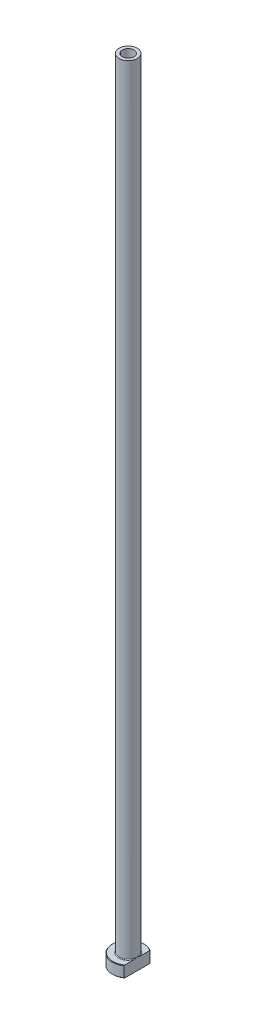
ISO-10303-21;
HEADER;
FILE_DESCRIPTION(('STEP AP214'),'2;1');
FILE_NAME('part.step','',(''),(''),'','','');
FILE_SCHEMA(('AUTOMOTIVE_DESIGN { 1 0 10303 214 1 1 1 1 }'));
ENDSEC;
DATA;
#1=APPLICATION_CONTEXT('core data for automotive mechanical design processes');
#2=APPLICATION_PROTOCOL_DEFINITION('international standard','automotive_design',2000,#1);
#3=PRODUCT_CONTEXT('',#1,'mechanical');
#4=PRODUCT('Part','Part','',(#3));
#5=PRODUCT_RELATED_PRODUCT_CATEGORY('part','',(#4));
#6=PRODUCT_DEFINITION_FORMATION('','',#4);
#7=PRODUCT_DEFINITION_CONTEXT('part definition',#1,'design');
#8=PRODUCT_DEFINITION('design','',#6,#7);
#9=PRODUCT_DEFINITION_SHAPE('','',#8);
#10=(LENGTH_UNIT() NAMED_UNIT(*) SI_UNIT(.MILLI.,.METRE.));
#11=(NAMED_UNIT(*) PLANE_ANGLE_UNIT() SI_UNIT($,.RADIAN.));
#12=(NAMED_UNIT(*) SI_UNIT($,.STERADIAN.) SOLID_ANGLE_UNIT());
#13=UNCERTAINTY_MEASURE_WITH_UNIT(LENGTH_MEASURE(1.E-05),#10,'distance_accuracy_value','');
#14=(GEOMETRIC_REPRESENTATION_CONTEXT(3) GLOBAL_UNCERTAINTY_ASSIGNED_CONTEXT((#13)) GLOBAL_UNIT_ASSIGNED_CONTEXT((#10,
#11,#12)) REPRESENTATION_CONTEXT('',''));
#15=CARTESIAN_POINT('',(0.,0.,0.));
#16=DIRECTION('',(0.,0.,1.));
#17=DIRECTION('',(1.,0.,0.));
#18=AXIS2_PLACEMENT_3D('',#15,#16,#17);
#19=CARTESIAN_POINT('',(0.,92.1876809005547,0.));
#20=DIRECTION('',(0.,1.,0.));
#21=DIRECTION('',(0.,0.,1.));
#22=AXIS2_PLACEMENT_3D('',#19,#20,#21);
#23=CYLINDRICAL_SURFACE('',#22,2.60000000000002);
#24=CARTESIAN_POINT('',(0.,350.,0.));
#25=DIRECTION('',(0.,1.,0.));
#26=DIRECTION('',(0.,0.,1.));
#27=AXIS2_PLACEMENT_3D('',#24,#25,#26);
#28=CIRCLE('',#27,2.60000000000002);
#29=CARTESIAN_POINT('',(0.,350.,2.60000000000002));
#30=VERTEX_POINT('',#29);
#31=EDGE_CURVE('E167',#30,#30,#28,.T.);
#32=ORIENTED_EDGE('',*,*,#31,.T.);
#33=EDGE_LOOP('',(#32));
#34=FACE_BOUND('',#33,.T.);
#35=CARTESIAN_POINT('',(0.,305.,0.));
#36=DIRECTION('',(0.,1.,0.));
#37=DIRECTION('',(0.,0.,1.));
#38=AXIS2_PLACEMENT_3D('',#35,#36,#37);
#39=CIRCLE('',#38,2.60000000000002);
#40=CARTESIAN_POINT('',(0.,305.,2.60000000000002));
#41=VERTEX_POINT('',#40);
#42=EDGE_CURVE('E170',#41,#41,#39,.T.);
#43=ORIENTED_EDGE('',*,*,#42,.F.);
#44=EDGE_LOOP('',(#43));
#45=FACE_BOUND('',#44,.T.);
#46=ADVANCED_FACE('F32',(#34,#45),#23,.F.);
#47=CARTESIAN_POINT('',(-2.60000000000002,350.,0.));
#48=DIRECTION('',(0.,1.,0.));
#49=DIRECTION('',(0.,0.,1.));
#50=AXIS2_PLACEMENT_3D('',#47,#48,#49);
#51=PLANE('',#50);
#52=CARTESIAN_POINT('',(0.,350.,0.));
#53=DIRECTION('',(0.,1.,0.));
#54=DIRECTION('',(0.,0.,1.));
#55=AXIS2_PLACEMENT_3D('',#52,#53,#54);
#56=CIRCLE('',#55,4.00000000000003);
#57=CARTESIAN_POINT('',(0.,350.,4.00000000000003));
#58=VERTEX_POINT('',#57);
#59=EDGE_CURVE('E174',#58,#58,#56,.T.);
#60=ORIENTED_EDGE('',*,*,#59,.T.);
#61=EDGE_LOOP('',(#60));
#62=FACE_BOUND('',#61,.T.);
#63=ORIENTED_EDGE('',*,*,#31,.F.);
#64=EDGE_LOOP('',(#63));
#65=FACE_BOUND('',#64,.T.);
#66=ADVANCED_FACE('F157',(#62,#65),#51,.T.);
#67=CARTESIAN_POINT('',(0.,92.1876809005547,0.));
#68=DIRECTION('',(0.,1.,0.));
#69=DIRECTION('',(0.,0.,1.));
#70=AXIS2_PLACEMENT_3D('',#67,#68,#69);
#71=CYLINDRICAL_SURFACE('',#70,4.00000000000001);
#72=CARTESIAN_POINT('',(0.,5.3,0.));
#73=DIRECTION('',(0.,1.,0.));
#74=DIRECTION('',(0.,0.,1.));
#75=AXIS2_PLACEMENT_3D('',#72,#73,#74);
#76=CIRCLE('',#75,4.00000000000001);
#77=CARTESIAN_POINT('',(4.,5.3,0.));
#78=VERTEX_POINT('',#77);
#79=EDGE_CURVE('E180',#78,#78,#76,.T.);
#80=ORIENTED_EDGE('',*,*,#79,.T.);
#81=EDGE_LOOP('',(#80));
#82=FACE_BOUND('',#81,.T.);
#83=ORIENTED_EDGE('',*,*,#59,.F.);
#84=EDGE_LOOP('',(#83));
#85=FACE_BOUND('',#84,.T.);
#86=ADVANCED_FACE('F162',(#82,#85),#71,.T.);
#87=CARTESIAN_POINT('',(-3.99999999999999,5.,0.));
#88=DIRECTION('',(0.,1.,0.));
#89=DIRECTION('',(0.,0.,1.));
#90=AXIS2_PLACEMENT_3D('',#87,#88,#89);
#91=PLANE('',#90);
#92=DIRECTION('',(0.,0.,1.));
#93=VECTOR('',#92,1.);
#94=CARTESIAN_POINT('',(4.,5.,0.));
#95=LINE('',#94,#93);
#96=CARTESIAN_POINT('',(4.,5.,-5.49909083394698));
#97=VERTEX_POINT('',#96);
#98=CARTESIAN_POINT('',(4.,5.,-1.57797338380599));
#99=VERTEX_POINT('',#98);
#100=EDGE_CURVE('E54',#97,#99,#95,.T.);
#101=ORIENTED_EDGE('',*,*,#100,.F.);
#102=CARTESIAN_POINT('',(0.,5.,0.));
#103=DIRECTION('',(0.,1.,0.));
#104=DIRECTION('',(0.,0.,1.));
#105=AXIS2_PLACEMENT_3D('',#102,#103,#104);
#106=CIRCLE('',#105,6.79999999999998);
#107=CARTESIAN_POINT('',(3.99999999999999,5.,5.49909083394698));
#108=VERTEX_POINT('',#107);
#109=EDGE_CURVE('E186',#97,#108,#106,.T.);
#110=ORIENTED_EDGE('',*,*,#109,.T.);
#111=CARTESIAN_POINT('',(4.,5.,1.57797338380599));
#112=VERTEX_POINT('',#111);
#113=EDGE_CURVE('E134',#112,#108,#95,.T.);
#114=ORIENTED_EDGE('',*,*,#113,.F.);
#115=CARTESIAN_POINT('',(0.,5.,0.));
#116=DIRECTION('',(0.,1.,0.));
#117=DIRECTION('',(0.,0.,1.));
#118=AXIS2_PLACEMENT_3D('',#115,#116,#117);
#119=CIRCLE('',#118,4.30000000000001);
#120=EDGE_CURVE('E183',#112,#99,#119,.F.);
#121=ORIENTED_EDGE('',*,*,#120,.T.);
#122=EDGE_LOOP('',(#101,#110,#114,#121));
#123=FACE_BOUND('',#122,.T.);
#124=ADVANCED_FACE('F197',(#123),#91,.T.);
#125=CARTESIAN_POINT('',(0.,92.1876809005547,0.));
#126=DIRECTION('',(0.,1.,0.));
#127=DIRECTION('',(0.,0.,1.));
#128=AXIS2_PLACEMENT_3D('',#125,#126,#127);
#129=CYLINDRICAL_SURFACE('',#128,6.99999999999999);
#130=DIRECTION('',(0.,-1.,0.));
#131=VECTOR('',#130,1.);
#132=CARTESIAN_POINT('',(3.99999999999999,350.,5.74456264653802));
#133=LINE('',#132,#131);
#134=CARTESIAN_POINT('',(3.99999999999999,4.8,5.74456264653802));
#135=VERTEX_POINT('',#134);
#136=CARTESIAN_POINT('',(3.99999999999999,0.199999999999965,5.74456264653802));
#137=VERTEX_POINT('',#136);
#138=EDGE_CURVE('E82',#135,#137,#133,.T.);
#139=ORIENTED_EDGE('',*,*,#138,.F.);
#140=CARTESIAN_POINT('',(0.,4.8,0.));
#141=DIRECTION('',(0.,1.,0.));
#142=DIRECTION('',(0.,0.,1.));
#143=AXIS2_PLACEMENT_3D('',#140,#141,#142);
#144=CIRCLE('',#143,6.99999999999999);
#145=CARTESIAN_POINT('',(4.,4.8,-5.74456264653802));
#146=VERTEX_POINT('',#145);
#147=EDGE_CURVE('E95',#135,#146,#144,.F.);
#148=ORIENTED_EDGE('',*,*,#147,.T.);
#149=DIRECTION('',(0.,-1.,0.));
#150=VECTOR('',#149,1.);
#151=CARTESIAN_POINT('',(4.,350.,-5.74456264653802));
#152=LINE('',#151,#150);
#153=CARTESIAN_POINT('',(4.,0.199999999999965,-5.74456264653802));
#154=VERTEX_POINT('',#153);
#155=EDGE_CURVE('E192',#146,#154,#152,.T.);
#156=ORIENTED_EDGE('',*,*,#155,.T.);
#157=CARTESIAN_POINT('',(0.,0.199999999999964,0.));
#158=DIRECTION('',(0.,-1.,0.));
#159=DIRECTION('',(0.,0.,-1.));
#160=AXIS2_PLACEMENT_3D('',#157,#158,#159);
#161=CIRCLE('',#160,6.99999999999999);
#162=EDGE_CURVE('E98',#154,#137,#161,.F.);
#163=ORIENTED_EDGE('',*,*,#162,.T.);
#164=EDGE_LOOP('',(#139,#148,#156,#163));
#165=FACE_BOUND('',#164,.T.);
#166=ADVANCED_FACE('F190',(#165),#129,.T.);
#167=CARTESIAN_POINT('',(-6.99999999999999,0.,0.));
#168=DIRECTION('',(0.,-1.,0.));
#169=DIRECTION('',(0.,0.,-1.));
#170=AXIS2_PLACEMENT_3D('',#167,#168,#169);
#171=PLANE('',#170);
#172=CARTESIAN_POINT('',(0.,0.,0.));
#173=DIRECTION('',(0.,-1.,0.));
#174=DIRECTION('',(0.,0.,-1.));
#175=AXIS2_PLACEMENT_3D('',#172,#173,#174);
#176=CIRCLE('',#175,3.34999999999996);
#177=CARTESIAN_POINT('',(0.,0.,-3.34999999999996));
#178=VERTEX_POINT('',#177);
#179=EDGE_CURVE('E40',#178,#178,#176,.F.);
#180=ORIENTED_EDGE('',*,*,#179,.T.);
#181=EDGE_LOOP('',(#180));
#182=FACE_BOUND('',#181,.T.);
#183=DIRECTION('',(0.,0.,-1.));
#184=VECTOR('',#183,1.);
#185=CARTESIAN_POINT('',(3.99999999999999,0.,5.74456264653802));
#186=LINE('',#185,#184);
#187=CARTESIAN_POINT('',(3.99999999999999,0.,5.49909083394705));
#188=VERTEX_POINT('',#187);
#189=CARTESIAN_POINT('',(4.,0.,-5.49909083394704));
#190=VERTEX_POINT('',#189);
#191=EDGE_CURVE('E47',#188,#190,#186,.T.);
#192=ORIENTED_EDGE('',*,*,#191,.F.);
#193=CARTESIAN_POINT('',(0.,0.,0.));
#194=DIRECTION('',(0.,-1.,0.));
#195=DIRECTION('',(0.,0.,-1.));
#196=AXIS2_PLACEMENT_3D('',#193,#194,#195);
#197=CIRCLE('',#196,6.80000000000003);
#198=EDGE_CURVE('E92',#188,#190,#197,.T.);
#199=ORIENTED_EDGE('',*,*,#198,.T.);
#200=EDGE_LOOP('',(#192,#199));
#201=FACE_BOUND('',#200,.T.);
#202=ADVANCED_FACE('F91',(#182,#201),#171,.T.);
#203=CARTESIAN_POINT('',(0.,92.1876809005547,0.));
#204=DIRECTION('',(0.,1.,0.));
#205=DIRECTION('',(0.,0.,1.));
#206=AXIS2_PLACEMENT_3D('',#203,#204,#205);
#207=CYLINDRICAL_SURFACE('',#206,2.85000000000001);
#208=CARTESIAN_POINT('',(0.,0.499999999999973,0.));
#209=DIRECTION('',(0.,-1.,0.));
#210=DIRECTION('',(0.,0.,-1.));
#211=AXIS2_PLACEMENT_3D('',#208,#209,#210);
#212=CIRCLE('',#211,2.85000000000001);
#213=CARTESIAN_POINT('',(0.,0.499999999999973,-2.85000000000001));
#214=VERTEX_POINT('',#213);
#215=EDGE_CURVE('E11',#214,#214,#212,.T.);
#216=ORIENTED_EDGE('',*,*,#215,.T.);
#217=EDGE_LOOP('',(#216));
#218=FACE_BOUND('',#217,.T.);
#219=CARTESIAN_POINT('',(0.,293.,0.));
#220=DIRECTION('',(0.,1.,0.));
#221=DIRECTION('',(0.,0.,1.));
#222=AXIS2_PLACEMENT_3D('',#219,#220,#221);
#223=CIRCLE('',#222,2.85000000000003);
#224=CARTESIAN_POINT('',(0.,293.,2.85000000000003));
#225=VERTEX_POINT('',#224);
#226=EDGE_CURVE('E172',#225,#225,#223,.T.);
#227=ORIENTED_EDGE('',*,*,#226,.T.);
#228=EDGE_LOOP('',(#227));
#229=FACE_BOUND('',#228,.T.);
#230=ADVANCED_FACE('F215',(#218,#229),#207,.F.);
#231=CARTESIAN_POINT('',(0.,293.,0.));
#232=DIRECTION('',(0.,-1.,0.));
#233=DIRECTION('',(0.,0.,-1.));
#234=AXIS2_PLACEMENT_3D('',#231,#232,#233);
#235=CONICAL_SURFACE('',#234,2.85000000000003,0.0208303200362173);
#236=ORIENTED_EDGE('',*,*,#42,.T.);
#237=EDGE_LOOP('',(#236));
#238=FACE_BOUND('',#237,.T.);
#239=ORIENTED_EDGE('',*,*,#226,.F.);
#240=EDGE_LOOP('',(#239));
#241=FACE_BOUND('',#240,.T.);
#242=ADVANCED_FACE('F111',(#238,#241),#235,.F.);
#243=CARTESIAN_POINT('',(0.,5.3,0.));
#244=DIRECTION('',(0.,1.,0.));
#245=DIRECTION('',(0.,0.,1.));
#246=AXIS2_PLACEMENT_3D('',#243,#244,#245);
#247=TOROIDAL_SURFACE('',#246,4.30000000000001,0.3);
#248=ORIENTED_EDGE('',*,*,#120,.F.);
#249=CARTESIAN_POINT('',(4.,5.3,0.));
#250=CARTESIAN_POINT('',(4.,5.30000062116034,-1.06261412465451E-10));
#251=CARTESIAN_POINT('',(4.,5.30000124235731,2.1772624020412E-07));
#252=CARTESIAN_POINT('',(4.,5.30000240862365,8.36141382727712E-07));
#253=CARTESIAN_POINT('',(4.,5.30000294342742,1.25011725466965E-06));
#254=CARTESIAN_POINT('',(4.,5.30000404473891,2.23959401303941E-06));
#255=CARTESIAN_POINT('',(4.,5.30000459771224,2.83084539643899E-06));
#256=CARTESIAN_POINT('',(4.,5.30000559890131,4.06516690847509E-06));
#257=CARTESIAN_POINT('',(4.,5.30000604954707,4.70640167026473E-06));
#258=CARTESIAN_POINT('',(4.,5.30000769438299,7.15677347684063E-06));
#259=CARTESIAN_POINT('',(4.,5.30000879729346,9.0299615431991E-06));
#260=CARTESIAN_POINT('',(4.,5.30001063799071,1.27664907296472E-05));
#261=CARTESIAN_POINT('',(4.,5.30001139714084,1.4619782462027E-05));
#262=CARTESIAN_POINT('',(4.,5.30001453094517,2.2367925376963E-05));
#263=CARTESIAN_POINT('',(4.,5.30001683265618,2.82968793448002E-05));
#264=CARTESIAN_POINT('',(4.,5.30002027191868,3.9566878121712E-05));
#265=CARTESIAN_POINT('',(4.,5.30002152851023,4.4871550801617E-05));
#266=CARTESIAN_POINT('',(4.,5.3000306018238,8.40118274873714E-05));
#267=CARTESIAN_POINT('',(4.,5.30003739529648,0.000118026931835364));
#268=CARTESIAN_POINT('',(3.99999999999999,5.30006713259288,0.000252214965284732));
#269=CARTESIAN_POINT('',(3.99999999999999,5.30009559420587,0.000351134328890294));
#270=CARTESIAN_POINT('',(4.,5.30020622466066,0.000742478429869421));
#271=CARTESIAN_POINT('',(4.,5.30028475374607,0.00103561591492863));
#272=CARTESIAN_POINT('',(3.99999999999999,5.30059889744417,0.00219920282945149));
#273=CARTESIAN_POINT('',(3.99999999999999,5.30083905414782,0.00306873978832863));
#274=CARTESIAN_POINT('',(4.,5.30183682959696,0.00669141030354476));
#275=CARTESIAN_POINT('',(4.,5.30258877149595,0.00944568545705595));
#276=CARTESIAN_POINT('',(3.99999999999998,5.31066890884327,0.0390293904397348));
#277=CARTESIAN_POINT('',(3.99999999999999,5.31802631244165,0.0658531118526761));
#278=CARTESIAN_POINT('',(4.,5.33239676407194,0.118441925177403));
#279=CARTESIAN_POINT('',(4.,5.33941183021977,0.144206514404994));
#280=CARTESIAN_POINT('',(3.99999999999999,5.35427366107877,0.199017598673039));
#281=CARTESIAN_POINT('',(4.,5.36211313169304,0.228066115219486));
#282=CARTESIAN_POINT('',(4.,5.37776349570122,0.286511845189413));
#283=CARTESIAN_POINT('',(4.,5.38557313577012,0.315909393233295));
#284=CARTESIAN_POINT('',(4.,5.40425662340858,0.386994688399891));
#285=CARTESIAN_POINT('',(4.,5.41505237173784,0.428703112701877));
#286=CARTESIAN_POINT('',(4.,5.43592310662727,0.511098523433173));
#287=CARTESIAN_POINT('',(4.,5.44600969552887,0.551782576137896));
#288=CARTESIAN_POINT('',(4.,5.47850986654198,0.686599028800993));
#289=CARTESIAN_POINT('',(4.,5.49978370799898,0.781011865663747));
#290=CARTESIAN_POINT('',(4.,5.53807543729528,0.971847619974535));
#291=CARTESIAN_POINT('',(4.,5.55504273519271,1.0682812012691));
#292=CARTESIAN_POINT('',(4.,5.57582405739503,1.21752725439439));
#293=CARTESIAN_POINT('',(4.,5.58209796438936,1.26999379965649));
#294=CARTESIAN_POINT('',(4.,5.59210686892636,1.37516324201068));
#295=CARTESIAN_POINT('',(4.,5.59584265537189,1.42786606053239));
#296=CARTESIAN_POINT('',(4.,5.60010438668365,1.53310673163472));
#297=CARTESIAN_POINT('',(4.,5.6006487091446,1.58564378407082));
#298=CARTESIAN_POINT('',(4.,5.59767158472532,1.69058605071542));
#299=CARTESIAN_POINT('',(4.,5.59415502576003,1.74299134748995));
#300=CARTESIAN_POINT('',(4.,5.58503062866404,1.81903290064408));
#301=CARTESIAN_POINT('',(4.,5.58157617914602,1.84292934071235));
#302=CARTESIAN_POINT('',(4.,5.57329952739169,1.89051061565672));
#303=CARTESIAN_POINT('',(4.,5.56847619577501,1.91419525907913));
#304=CARTESIAN_POINT('',(4.,5.55726644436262,1.96092888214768));
#305=CARTESIAN_POINT('',(4.,5.55089740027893,1.98398195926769));
#306=CARTESIAN_POINT('',(4.,5.53623434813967,2.02945550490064));
#307=CARTESIAN_POINT('',(4.,5.5279425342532,2.05187666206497));
#308=CARTESIAN_POINT('',(4.,5.50887098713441,2.09590631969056));
#309=CARTESIAN_POINT('',(4.,5.49806837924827,2.11750508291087));
#310=CARTESIAN_POINT('',(4.,5.47333401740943,2.15885583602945));
#311=CARTESIAN_POINT('',(4.,5.45941272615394,2.17861369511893));
#312=CARTESIAN_POINT('',(4.,5.43588221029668,2.20522942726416));
#313=CARTESIAN_POINT('',(4.,5.42781139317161,2.21344043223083));
#314=CARTESIAN_POINT('',(4.,5.41065114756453,2.22875149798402));
#315=CARTESIAN_POINT('',(4.,5.40156129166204,2.2358510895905));
#316=CARTESIAN_POINT('',(4.,5.38220524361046,2.2485969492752));
#317=CARTESIAN_POINT('',(4.,5.37192420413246,2.25422119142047));
#318=CARTESIAN_POINT('',(4.,5.35045072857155,2.26331064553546));
#319=CARTESIAN_POINT('',(4.,5.33926122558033,2.26678251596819));
#320=CARTESIAN_POINT('',(4.,5.31952044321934,2.27051268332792));
#321=CARTESIAN_POINT('',(4.,5.31108453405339,2.27139016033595));
#322=CARTESIAN_POINT('',(4.,5.29418624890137,2.27168963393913));
#323=CARTESIAN_POINT('',(4.,5.28572387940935,2.2711119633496));
#324=CARTESIAN_POINT('',(4.,5.26904138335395,2.26855580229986));
#325=CARTESIAN_POINT('',(4.,5.26082066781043,2.26658107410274));
#326=CARTESIAN_POINT('',(4.,5.24478214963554,2.26139496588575));
#327=CARTESIAN_POINT('',(4.,5.23696461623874,2.25818277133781));
#328=CARTESIAN_POINT('',(4.,5.21851235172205,2.24908332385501));
#329=CARTESIAN_POINT('',(4.,5.20815219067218,2.24264095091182));
#330=CARTESIAN_POINT('',(4.,5.18857975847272,2.22819957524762));
#331=CARTESIAN_POINT('',(4.,5.17937061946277,2.22019647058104));
#332=CARTESIAN_POINT('',(4.,5.15665383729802,2.19777756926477));
#333=CARTESIAN_POINT('',(4.,5.1440348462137,2.18246908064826));
#334=CARTESIAN_POINT('',(4.,5.12118369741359,2.1502084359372));
#335=CARTESIAN_POINT('',(4.,5.11095480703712,2.13325407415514));
#336=CARTESIAN_POINT('',(4.,5.09273574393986,2.09892324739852));
#337=CARTESIAN_POINT('',(4.,5.0846821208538,2.08157988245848));
#338=CARTESIAN_POINT('',(4.,5.07005901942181,2.04627072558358));
#339=CARTESIAN_POINT('',(4.,5.06349101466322,2.02830433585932));
#340=CARTESIAN_POINT('',(4.,5.04555485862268,1.97350761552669));
#341=CARTESIAN_POINT('',(4.,5.03608974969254,1.93605770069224));
#342=CARTESIAN_POINT('',(4.,5.01780569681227,1.84529235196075));
#343=CARTESIAN_POINT('',(4.,5.01077018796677,1.79164082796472));
#344=CARTESIAN_POINT('',(4.,5.0018284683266,1.68379947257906));
#345=CARTESIAN_POINT('',(4.,4.99993887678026,1.62960846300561));
#346=CARTESIAN_POINT('',(4.,5.00006129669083,1.52361204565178));
#347=CARTESIAN_POINT('',(4.,5.00190698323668,1.47180551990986));
#348=CARTESIAN_POINT('',(4.,5.00841243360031,1.36835357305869));
#349=CARTESIAN_POINT('',(4.,5.01307376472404,1.3167082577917));
#350=CARTESIAN_POINT('',(4.,5.02905484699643,1.17431887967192));
#351=CARTESIAN_POINT('',(4.,5.0427409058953,1.08384207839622));
#352=CARTESIAN_POINT('',(4.,5.06701714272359,0.947757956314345));
#353=CARTESIAN_POINT('',(4.,5.0758557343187,0.901814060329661));
#354=CARTESIAN_POINT('',(4.,5.09458665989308,0.810008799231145));
#355=CARTESIAN_POINT('',(4.,5.10448180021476,0.764148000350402));
#356=CARTESIAN_POINT('',(4.,5.12892434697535,0.655631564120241));
#357=CARTESIAN_POINT('',(4.,5.14383556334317,0.593058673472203));
#358=CARTESIAN_POINT('',(4.,5.17458762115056,0.468885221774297));
#359=CARTESIAN_POINT('',(4.,5.19041623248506,0.407281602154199));
#360=CARTESIAN_POINT('',(4.,5.22090834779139,0.291232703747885));
#361=CARTESIAN_POINT('',(4.,5.2355002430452,0.236768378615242));
#362=CARTESIAN_POINT('',(4.,5.26562550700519,0.125604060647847));
#363=CARTESIAN_POINT('',(4.,5.28117250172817,0.0689076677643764));
#364=CARTESIAN_POINT('',(4.,5.29741226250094,0.00944154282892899));
#365=CARTESIAN_POINT('',(4.,5.29816540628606,0.00668315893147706));
#366=CARTESIAN_POINT('',(4.,5.29916346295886,0.00305954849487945));
#367=CARTESIAN_POINT('',(4.,5.29940273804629,0.00219318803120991));
#368=CARTESIAN_POINT('',(4.,5.29971580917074,0.00103357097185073));
#369=CARTESIAN_POINT('',(4.,5.29979412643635,0.000741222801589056));
#370=CARTESIAN_POINT('',(4.,5.29990450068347,0.000350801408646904));
#371=CARTESIAN_POINT('',(4.,5.29993292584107,0.000252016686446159));
#372=CARTESIAN_POINT('',(4.,5.29996263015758,0.000117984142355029));
#373=CARTESIAN_POINT('',(4.,5.29996941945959,8.39881966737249E-05));
#374=CARTESIAN_POINT('',(4.,5.29997848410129,4.48674057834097E-05));
#375=CARTESIAN_POINT('',(4.,5.29997973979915,3.9563823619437E-05));
#376=CARTESIAN_POINT('',(4.,5.29998317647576,2.82960377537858E-05));
#377=CARTESIAN_POINT('',(4.,5.29998547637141,2.23681484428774E-05));
#378=CARTESIAN_POINT('',(4.,5.299988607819,1.46211017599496E-05));
#379=CARTESIAN_POINT('',(4.,5.29998936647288,1.27678917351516E-05));
#380=CARTESIAN_POINT('',(4.,5.29999120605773,9.03144206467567E-06));
#381=CARTESIAN_POINT('',(4.,5.29999230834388,7.15824206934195E-06));
#382=CARTESIAN_POINT('',(4.,5.2999939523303,4.70775594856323E-06));
#383=CARTESIAN_POINT('',(4.,5.29999440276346,4.06646461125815E-06));
#384=CARTESIAN_POINT('',(4.,5.29999540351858,2.83199157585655E-06));
#385=CARTESIAN_POINT('',(4.,5.29999595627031,2.24064402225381E-06));
#386=CARTESIAN_POINT('',(4.,5.29999705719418,1.25094014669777E-06));
#387=CARTESIAN_POINT('',(4.,5.29999759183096,8.36841437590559E-07));
#388=CARTESIAN_POINT('',(4.,5.29999875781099,2.1811792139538E-07));
#389=CARTESIAN_POINT('',(4.,5.29999937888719,1.06254489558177E-10));
#390=CARTESIAN_POINT('',(4.,5.3,0.));
#391=B_SPLINE_CURVE_WITH_KNOTS('',3,(#249,#250,#251,#252,#253,#254,#255,#256,#257,#258,#259,
#260,#261,#262,#263,#264,#265,#266,#267,#268,#269,#270,#271,#272,#273,#274,#275,#276,#277,#278,
#279,#280,#281,#282,#283,#284,#285,#286,#287,#288,#289,#290,#291,#292,#293,#294,#295,#296,#297,
#298,#299,#300,#301,#302,#303,#304,#305,#306,#307,#308,#309,#310,#311,#312,#313,#314,#315,#316,
#317,#318,#319,#320,#321,#322,#323,#324,#325,#326,#327,#328,#329,#330,#331,#332,#333,#334,#335,
#336,#337,#338,#339,#340,#341,#342,#343,#344,#345,#346,#347,#348,#349,#350,#351,#352,#353,#354,
#355,#356,#357,#358,#359,#360,#361,#362,#363,#364,#365,#366,#367,#368,#369,#370,#371,#372,#373,
#374,#375,#376,#377,#378,#379,#380,#381,#382,#383,#384,#385,#386,#387,#388,#389,#390),
.UNSPECIFIED.,.T.,.F.,(4,2,2,2,2,2,2,2,2,2,2,2,2,2,2,2,2,2,2,2,2,2,2,2,2,2,2,2,2,2,2,2,2,2,2,2,
2,2,2,2,2,2,2,2,2,2,2,2,2,2,2,2,2,2,2,2,2,2,2,2,2,2,2,2,2,2,2,2,2,2,4),(0.,1.87484217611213E-06,
3.90179668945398E-06,6.31683388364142E-06,8.66651407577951E-06,1.51627490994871E-05,
2.11657852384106E-05,4.02090700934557E-05,5.65429373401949E-05,0.000160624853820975,
0.000469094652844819,0.00137985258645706,0.00408571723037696,0.0126514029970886,
0.0960918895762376,0.176200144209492,0.266463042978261,0.357714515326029,0.486961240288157,
0.6127070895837,0.902988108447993,1.19653589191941,1.3550107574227,1.51343634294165,
1.67094875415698,1.82827177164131,1.90067591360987,1.97313996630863,2.04482437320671,
2.11642737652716,2.18871023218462,2.26075412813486,2.29521947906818,2.32969934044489,
2.36466792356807,2.39952778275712,2.4248542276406,2.45017488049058,2.47542760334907,
2.5006969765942,2.53708899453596,2.57357798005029,2.63276032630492,2.69202310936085,
2.74930315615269,2.80663977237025,2.92223125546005,3.08420752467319,3.24670629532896,
3.4021285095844,3.55763731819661,3.83192962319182,3.9722838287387,4.11302057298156,
4.30598130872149,4.49678885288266,4.66594443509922,4.84230602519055,4.85088453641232,
4.85358051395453,4.85448881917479,4.85479687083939,4.85490089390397,4.8549172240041,
4.85493626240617,4.85494226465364,4.85494875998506,4.85495110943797,4.85495352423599,
4.85495555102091,4.85495742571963),.UNSPECIFIED.);
#392=EDGE_CURVE('E126',#112,#78,#391,.T.);
#393=ORIENTED_EDGE('',*,*,#392,.T.);
#394=ORIENTED_EDGE('',*,*,#79,.F.);
#395=CARTESIAN_POINT('',(4.,5.3,0.));
#396=CARTESIAN_POINT('',(4.,5.29999937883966,1.062626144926E-10));
#397=CARTESIAN_POINT('',(4.,5.29999875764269,-2.1772623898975E-07));
#398=CARTESIAN_POINT('',(4.,5.29999759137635,-8.3614138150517E-07));
#399=CARTESIAN_POINT('',(4.,5.29999705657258,-1.25011725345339E-06));
#400=CARTESIAN_POINT('',(4.,5.29999595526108,-2.23959401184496E-06));
#401=CARTESIAN_POINT('',(4.,5.29999540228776,-2.83084539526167E-06));
#402=CARTESIAN_POINT('',(4.,5.29999440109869,-4.06516690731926E-06));
#403=CARTESIAN_POINT('',(4.,5.29999395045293,-4.70640166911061E-06));
#404=CARTESIAN_POINT('',(4.,5.29999230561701,-7.15677347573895E-06));
#405=CARTESIAN_POINT('',(4.,5.29999120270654,-9.02996154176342E-06));
#406=CARTESIAN_POINT('',(4.,5.29998936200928,-1.2766490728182E-05));
#407=CARTESIAN_POINT('',(4.,5.29998860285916,-1.46197824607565E-05));
#408=CARTESIAN_POINT('',(4.,5.29998546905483,-2.23679253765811E-05));
#409=CARTESIAN_POINT('',(4.,5.29998316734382,-2.82968793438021E-05));
#410=CARTESIAN_POINT('',(4.,5.29997972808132,-3.95668781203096E-05));
#411=CARTESIAN_POINT('',(4.,5.29997847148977,-4.48715508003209E-05));
#412=CARTESIAN_POINT('',(4.,5.2999693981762,-8.4011827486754E-05));
#413=CARTESIAN_POINT('',(4.,5.29996260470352,-0.000118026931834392));
#414=CARTESIAN_POINT('',(4.,5.29993286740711,-0.000252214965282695));
#415=CARTESIAN_POINT('',(4.,5.29990440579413,-0.00035113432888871));
#416=CARTESIAN_POINT('',(4.,5.29979377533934,-0.000742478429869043));
#417=CARTESIAN_POINT('',(4.,5.29971524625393,-0.00103561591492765));
#418=CARTESIAN_POINT('',(4.,5.29940110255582,-0.00219920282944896));
#419=CARTESIAN_POINT('',(4.,5.29916094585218,-0.0030687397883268));
#420=CARTESIAN_POINT('',(4.,5.29816317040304,-0.00669141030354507));
#421=CARTESIAN_POINT('',(4.,5.29741122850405,-0.00944568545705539));
#422=CARTESIAN_POINT('',(4.,5.28933109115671,-0.0390293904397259));
#423=CARTESIAN_POINT('',(4.,5.28197368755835,-0.0658531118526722));
#424=CARTESIAN_POINT('',(4.,5.26760323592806,-0.118441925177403));
#425=CARTESIAN_POINT('',(4.,5.26058816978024,-0.144206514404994));
#426=CARTESIAN_POINT('',(4.,5.24572633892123,-0.199017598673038));
#427=CARTESIAN_POINT('',(4.,5.23788686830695,-0.228066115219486));
#428=CARTESIAN_POINT('',(4.,5.22223650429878,-0.286511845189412));
#429=CARTESIAN_POINT('',(4.,5.21442686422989,-0.315909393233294));
#430=CARTESIAN_POINT('',(4.,5.19574337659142,-0.38699468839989));
#431=CARTESIAN_POINT('',(4.,5.18494762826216,-0.428703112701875));
#432=CARTESIAN_POINT('',(4.,5.16407689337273,-0.511098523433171));
#433=CARTESIAN_POINT('',(4.,5.15399030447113,-0.551782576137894));
#434=CARTESIAN_POINT('',(4.,5.12149013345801,-0.686599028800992));
#435=CARTESIAN_POINT('',(4.,5.10021629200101,-0.781011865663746));
#436=CARTESIAN_POINT('',(4.,5.06192456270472,-0.971847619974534));
#437=CARTESIAN_POINT('',(4.,5.04495726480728,-1.0682812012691));
#438=CARTESIAN_POINT('',(4.,5.02417594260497,-1.21752725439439));
#439=CARTESIAN_POINT('',(4.,5.01790203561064,-1.26999379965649));
#440=CARTESIAN_POINT('',(4.,5.00789313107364,-1.37516324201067));
#441=CARTESIAN_POINT('',(4.,5.00415734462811,-1.42786606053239));
#442=CARTESIAN_POINT('',(4.,4.99989561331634,-1.53310673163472));
#443=CARTESIAN_POINT('',(4.,4.9993512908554,-1.58564378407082));
#444=CARTESIAN_POINT('',(4.,5.00232841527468,-1.69058605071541));
#445=CARTESIAN_POINT('',(4.,5.00584497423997,-1.74299134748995));
#446=CARTESIAN_POINT('',(4.,5.01496937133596,-1.81903290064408));
#447=CARTESIAN_POINT('',(4.,5.01842382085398,-1.84292934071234));
#448=CARTESIAN_POINT('',(4.,5.02670047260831,-1.89051061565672));
#449=CARTESIAN_POINT('',(4.,5.03152380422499,-1.91419525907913));
#450=CARTESIAN_POINT('',(4.,5.04273355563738,-1.96092888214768));
#451=CARTESIAN_POINT('',(4.,5.04910259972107,-1.98398195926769));
#452=CARTESIAN_POINT('',(4.,5.06376565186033,-2.02945550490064));
#453=CARTESIAN_POINT('',(4.,5.0720574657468,-2.05187666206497));
#454=CARTESIAN_POINT('',(4.,5.09112901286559,-2.09590631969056));
#455=CARTESIAN_POINT('',(4.,5.10193162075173,-2.11750508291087));
#456=CARTESIAN_POINT('',(4.,5.12666598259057,-2.15885583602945));
#457=CARTESIAN_POINT('',(4.,5.14058727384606,-2.17861369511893));
#458=CARTESIAN_POINT('',(4.,5.16411778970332,-2.20522942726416));
#459=CARTESIAN_POINT('',(4.,5.17218860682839,-2.21344043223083));
#460=CARTESIAN_POINT('',(4.,5.18934885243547,-2.22875149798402));
#461=CARTESIAN_POINT('',(4.,5.19843870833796,-2.2358510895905));
#462=CARTESIAN_POINT('',(4.,5.21779475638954,-2.2485969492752));
#463=CARTESIAN_POINT('',(4.,5.22807579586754,-2.25422119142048));
#464=CARTESIAN_POINT('',(4.,5.24954927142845,-2.26331064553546));
#465=CARTESIAN_POINT('',(4.,5.26073877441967,-2.26678251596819));
#466=CARTESIAN_POINT('',(4.,5.28047955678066,-2.27051268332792));
#467=CARTESIAN_POINT('',(4.,5.28891546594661,-2.27139016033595));
#468=CARTESIAN_POINT('',(4.,5.30581375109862,-2.27168963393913));
#469=CARTESIAN_POINT('',(4.,5.31427612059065,-2.2711119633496));
#470=CARTESIAN_POINT('',(4.,5.33095861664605,-2.26855580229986));
#471=CARTESIAN_POINT('',(4.,5.33917933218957,-2.26658107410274));
#472=CARTESIAN_POINT('',(4.,5.35521785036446,-2.26139496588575));
#473=CARTESIAN_POINT('',(4.,5.36303538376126,-2.25818277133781));
#474=CARTESIAN_POINT('',(4.,5.38148764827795,-2.24908332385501));
#475=CARTESIAN_POINT('',(4.,5.39184780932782,-2.24264095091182));
#476=CARTESIAN_POINT('',(4.,5.41142024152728,-2.22819957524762));
#477=CARTESIAN_POINT('',(4.,5.42062938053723,-2.22019647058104));
#478=CARTESIAN_POINT('',(4.,5.44334616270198,-2.19777756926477));
#479=CARTESIAN_POINT('',(4.,5.4559651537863,-2.18246908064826));
#480=CARTESIAN_POINT('',(4.,5.4788163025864,-2.1502084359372));
#481=CARTESIAN_POINT('',(4.,5.48904519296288,-2.13325407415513));
#482=CARTESIAN_POINT('',(4.,5.50726425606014,-2.09892324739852));
#483=CARTESIAN_POINT('',(4.,5.5153178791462,-2.08157988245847));
#484=CARTESIAN_POINT('',(4.,5.5299409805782,-2.04627072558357));
#485=CARTESIAN_POINT('',(4.,5.53650898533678,-2.02830433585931));
#486=CARTESIAN_POINT('',(4.,5.55444514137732,-1.97350761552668));
#487=CARTESIAN_POINT('',(4.,5.56391025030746,-1.93605770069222));
#488=CARTESIAN_POINT('',(4.,5.58219430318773,-1.84529235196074));
#489=CARTESIAN_POINT('',(4.,5.58922981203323,-1.7916408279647));
#490=CARTESIAN_POINT('',(4.,5.5981715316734,-1.68379947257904));
#491=CARTESIAN_POINT('',(4.,5.60006112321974,-1.62960846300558));
#492=CARTESIAN_POINT('',(4.,5.59993870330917,-1.52361204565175));
#493=CARTESIAN_POINT('',(4.,5.59809301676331,-1.47180551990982));
#494=CARTESIAN_POINT('',(4.,5.59158756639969,-1.36835357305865));
#495=CARTESIAN_POINT('',(4.,5.58692623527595,-1.31670825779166));
#496=CARTESIAN_POINT('',(4.,5.57094515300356,-1.17431887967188));
#497=CARTESIAN_POINT('',(4.,5.5572590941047,-1.08384207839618));
#498=CARTESIAN_POINT('',(4.,5.5329828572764,-0.947757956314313));
#499=CARTESIAN_POINT('',(4.,5.52414426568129,-0.90181406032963));
#500=CARTESIAN_POINT('',(4.,5.50541334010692,-0.810008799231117));
#501=CARTESIAN_POINT('',(4.,5.49551819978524,-0.764148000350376));
#502=CARTESIAN_POINT('',(4.,5.47107565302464,-0.65563156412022));
#503=CARTESIAN_POINT('',(4.,5.45616443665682,-0.593058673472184));
#504=CARTESIAN_POINT('',(4.,5.42541237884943,-0.468885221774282));
#505=CARTESIAN_POINT('',(4.,5.40958376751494,-0.407281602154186));
#506=CARTESIAN_POINT('',(4.,5.3790916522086,-0.291232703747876));
#507=CARTESIAN_POINT('',(4.,5.3644997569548,-0.236768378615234));
#508=CARTESIAN_POINT('',(4.,5.33437449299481,-0.125604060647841));
#509=CARTESIAN_POINT('',(4.,5.31882749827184,-0.0689076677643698));
#510=CARTESIAN_POINT('',(4.,5.30258773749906,-0.00944154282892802));
#511=CARTESIAN_POINT('',(4.,5.30183459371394,-0.00668315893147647));
#512=CARTESIAN_POINT('',(4.,5.30083653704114,-0.00305954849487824));
#513=CARTESIAN_POINT('',(4.,5.30059726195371,-0.00219318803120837));
#514=CARTESIAN_POINT('',(4.,5.30028419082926,-0.00103357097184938));
#515=CARTESIAN_POINT('',(4.,5.30020587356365,-0.000741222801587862));
#516=CARTESIAN_POINT('',(4.,5.30009549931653,-0.000350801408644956));
#517=CARTESIAN_POINT('',(4.,5.30006707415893,-0.000252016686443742));
#518=CARTESIAN_POINT('',(4.,5.30003736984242,-0.000117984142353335));
#519=CARTESIAN_POINT('',(4.,5.30003058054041,-8.3988196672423E-05));
#520=CARTESIAN_POINT('',(4.,5.30002151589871,-4.48674057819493E-05));
#521=CARTESIAN_POINT('',(4.,5.30002026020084,-3.95638236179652E-05));
#522=CARTESIAN_POINT('',(4.,5.30001682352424,-2.82960377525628E-05));
#523=CARTESIAN_POINT('',(4.,5.30001452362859,-2.23681484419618E-05));
#524=CARTESIAN_POINT('',(4.,5.300011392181,-1.46211017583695E-05));
#525=CARTESIAN_POINT('',(4.,5.30001063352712,-1.27678917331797E-05));
#526=CARTESIAN_POINT('',(4.,5.30000879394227,-9.03144206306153E-06));
#527=CARTESIAN_POINT('',(4.,5.30000769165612,-7.15824206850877E-06));
#528=CARTESIAN_POINT('',(4.,5.30000604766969,-4.70775594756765E-06));
#529=CARTESIAN_POINT('',(4.,5.30000559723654,-4.06646461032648E-06));
#530=CARTESIAN_POINT('',(4.,5.30000459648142,-2.831991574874E-06));
#531=CARTESIAN_POINT('',(4.,5.30000404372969,-2.24064402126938E-06));
#532=CARTESIAN_POINT('',(4.,5.30000294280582,-1.25094014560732E-06));
#533=CARTESIAN_POINT('',(4.,5.30000240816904,-8.36841436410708E-07));
#534=CARTESIAN_POINT('',(4.,5.30000124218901,-2.18117920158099E-07));
#535=CARTESIAN_POINT('',(4.,5.30000062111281,-1.06253275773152E-10));
#536=CARTESIAN_POINT('',(4.,5.3,0.));
#537=B_SPLINE_CURVE_WITH_KNOTS('',3,(#395,#396,#397,#398,#399,#400,#401,#402,#403,#404,#405,
#406,#407,#408,#409,#410,#411,#412,#413,#414,#415,#416,#417,#418,#419,#420,#421,#422,#423,#424,
#425,#426,#427,#428,#429,#430,#431,#432,#433,#434,#435,#436,#437,#438,#439,#440,#441,#442,#443,
#444,#445,#446,#447,#448,#449,#450,#451,#452,#453,#454,#455,#456,#457,#458,#459,#460,#461,#462,
#463,#464,#465,#466,#467,#468,#469,#470,#471,#472,#473,#474,#475,#476,#477,#478,#479,#480,#481,
#482,#483,#484,#485,#486,#487,#488,#489,#490,#491,#492,#493,#494,#495,#496,#497,#498,#499,#500,
#501,#502,#503,#504,#505,#506,#507,#508,#509,#510,#511,#512,#513,#514,#515,#516,#517,#518,#519,
#520,#521,#522,#523,#524,#525,#526,#527,#528,#529,#530,#531,#532,#533,#534,#535,#536),
.UNSPECIFIED.,.T.,.F.,(4,2,2,2,2,2,2,2,2,2,2,2,2,2,2,2,2,2,2,2,2,2,2,2,2,2,2,2,2,2,2,2,2,2,2,2,
2,2,2,2,2,2,2,2,2,2,2,2,2,2,2,2,2,2,2,2,2,2,2,2,2,2,2,2,2,2,2,2,2,2,4),(0.,1.87484217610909E-06,
3.90179668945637E-06,6.31683388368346E-06,8.66651407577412E-06,1.51627491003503E-05,
2.11657852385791E-05,4.020907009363E-05,5.65429373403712E-05,0.000160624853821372,
0.000469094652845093,0.00137985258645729,0.00408571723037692,0.0126514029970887,
0.0960918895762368,0.176200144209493,0.266463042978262,0.357714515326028,0.486961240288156,
0.612707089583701,0.902988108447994,1.19653589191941,1.3550107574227,1.51343634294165,
1.67094875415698,1.82827177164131,1.90067591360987,1.97313996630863,2.04482437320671,
2.11642737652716,2.18871023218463,2.26075412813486,2.29521947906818,2.32969934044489,
2.36466792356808,2.39952778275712,2.4248542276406,2.45017488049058,2.47542760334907,
2.5006969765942,2.53708899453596,2.57357798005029,2.63276032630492,2.69202310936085,
2.7493031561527,2.80663977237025,2.92223125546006,3.08420752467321,3.24670629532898,
3.40212850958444,3.55763731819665,3.83192962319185,3.97228382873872,4.11302057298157,
4.3059813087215,4.49678885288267,4.66594443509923,4.84230602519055,4.85088453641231,
4.85358051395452,4.85448881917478,4.85479687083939,4.85490089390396,4.8549172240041,
4.85493626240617,4.85494226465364,4.85494875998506,4.85495110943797,4.85495352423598,
4.85495555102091,4.85495742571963),.UNSPECIFIED.);
#538=EDGE_CURVE('E135',#78,#99,#537,.T.);
#539=ORIENTED_EDGE('',*,*,#538,.T.);
#540=EDGE_LOOP('',(#248,#393,#394,#539));
#541=FACE_BOUND('',#540,.T.);
#542=ADVANCED_FACE('F141',(#541),#247,.F.);
#543=CARTESIAN_POINT('',(0.,5.,0.));
#544=DIRECTION('',(0.,-1.,0.));
#545=DIRECTION('',(0.,0.,-1.));
#546=AXIS2_PLACEMENT_3D('',#543,#544,#545);
#547=CONICAL_SURFACE('',#546,6.79999999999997,0.785398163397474);
#548=CARTESIAN_POINT('',(4.,-1.45712845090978,-12.6392822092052));
#549=CARTESIAN_POINT('',(4.,-1.24364466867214,-12.4153556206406));
#550=CARTESIAN_POINT('',(4.,-1.03042430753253,-12.1911774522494));
#551=CARTESIAN_POINT('',(4.,-0.604617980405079,-11.7422167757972));
#552=CARTESIAN_POINT('',(4.,-0.392032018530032,-11.5174342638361));
#553=CARTESIAN_POINT('',(4.,0.0324624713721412,-11.0670952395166));
#554=CARTESIAN_POINT('',(4.,0.244370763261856,-10.8415385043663));
#555=CARTESIAN_POINT('',(4.,0.667290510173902,-10.3895875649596));
#556=CARTESIAN_POINT('',(4.,0.878301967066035,-10.1631933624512));
#557=CARTESIAN_POINT('',(4.,1.5138537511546,-9.47810122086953));
#558=CARTESIAN_POINT('',(4.,1.93676291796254,-9.01788214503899));
#559=CARTESIAN_POINT('',(4.,2.56612335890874,-8.32309905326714));
#560=CARTESIAN_POINT('',(4.,2.77505666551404,-8.0907845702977));
#561=CARTESIAN_POINT('',(4.,3.19080254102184,-7.62426940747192));
#562=CARTESIAN_POINT('',(4.,3.39761512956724,-7.39006874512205));
#563=CARTESIAN_POINT('',(4.,3.87870763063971,-6.838918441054));
#564=CARTESIAN_POINT('',(4.,4.15190978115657,-6.52102188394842));
#565=CARTESIAN_POINT('',(4.,4.55642425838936,-6.03960901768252));
#566=CARTESIAN_POINT('',(4.,4.69041050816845,-5.87833992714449));
#567=CARTESIAN_POINT('',(4.,4.95616531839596,-5.5539846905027));
#568=CARTESIAN_POINT('',(4.,5.08793391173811,-5.39089857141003));
#569=CARTESIAN_POINT('',(4.,5.34841712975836,-5.06288801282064));
#570=CARTESIAN_POINT('',(4.,5.47713786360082,-4.89796843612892));
#571=CARTESIAN_POINT('',(4.,5.73107494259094,-4.56545535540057));
#572=CARTESIAN_POINT('',(4.,5.85629144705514,-4.39786197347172));
#573=CARTESIAN_POINT('',(4.,6.10211465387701,-4.05948444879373));
#574=CARTESIAN_POINT('',(4.,6.22272435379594,-3.8887024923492));
#575=CARTESIAN_POINT('',(4.,6.45796076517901,-3.54308312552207));
#576=CARTESIAN_POINT('',(4.,6.57258867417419,-3.36824653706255));
#577=CARTESIAN_POINT('',(4.,6.76866603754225,-3.05381396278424));
#578=CARTESIAN_POINT('',(4.,6.85173773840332,-2.91523359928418));
#579=CARTESIAN_POINT('',(4.,7.01174537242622,-2.63451965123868));
#580=CARTESIAN_POINT('',(4.,7.0886804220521,-2.49238555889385));
#581=CARTESIAN_POINT('',(4.,7.2345943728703,-2.20416961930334));
#582=CARTESIAN_POINT('',(4.,7.30357836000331,-2.05809037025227));
#583=CARTESIAN_POINT('',(4.,7.43135520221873,-1.76151732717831));
#584=CARTESIAN_POINT('',(4.,7.49015114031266,-1.61102488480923));
#585=CARTESIAN_POINT('',(4.,7.58249315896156,-1.34142099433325));
#586=CARTESIAN_POINT('',(4.,7.61872660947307,-1.22323501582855));
#587=CARTESIAN_POINT('',(4.,7.68223354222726,-0.98449286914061));
#588=CARTESIAN_POINT('',(4.,7.70951040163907,-0.863937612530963));
#589=CARTESIAN_POINT('',(4.,7.75377914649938,-0.621342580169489));
#590=CARTESIAN_POINT('',(4.,7.77080509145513,-0.499309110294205));
#591=CARTESIAN_POINT('',(4.,7.79378778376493,-0.254194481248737));
#592=CARTESIAN_POINT('',(4.,7.79974523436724,-0.131113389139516));
#593=CARTESIAN_POINT('',(4.,7.80023957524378,0.115517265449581));
#594=CARTESIAN_POINT('',(4.,7.79473514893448,0.239066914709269));
#595=CARTESIAN_POINT('',(4.,7.77255119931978,0.485148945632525));
#596=CARTESIAN_POINT('',(4.,7.75587091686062,0.607681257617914));
#597=CARTESIAN_POINT('',(4.,7.71218353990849,0.851269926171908));
#598=CARTESIAN_POINT('',(4.,7.68514362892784,0.972320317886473));
#599=CARTESIAN_POINT('',(4.,7.6220120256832,1.21200276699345));
#600=CARTESIAN_POINT('',(4.,7.58591962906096,1.33063463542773));
#601=CARTESIAN_POINT('',(4.,7.4598007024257,1.70122439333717));
#602=CARTESIAN_POINT('',(4.,7.35572950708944,1.94843335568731));
#603=CARTESIAN_POINT('',(4.,7.18186715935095,2.31048534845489));
#604=CARTESIAN_POINT('',(4.,7.12087684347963,2.42983561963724));
#605=CARTESIAN_POINT('',(4.,6.99403531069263,2.66593629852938));
#606=CARTESIAN_POINT('',(3.99999999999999,6.92818466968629,2.78268701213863));
#607=CARTESIAN_POINT('',(3.99999999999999,6.79157875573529,3.01550895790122));
#608=CARTESIAN_POINT('',(3.99999999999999,6.72076681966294,3.13154660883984));
#609=CARTESIAN_POINT('',(3.99999999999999,6.57583116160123,3.36153379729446));
#610=CARTESIAN_POINT('',(3.99999999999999,6.50170736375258,3.47548328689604));
#611=CARTESIAN_POINT('',(3.99999999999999,6.35080982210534,3.70145107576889));
#612=CARTESIAN_POINT('',(3.99999999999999,6.27403866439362,3.81347110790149));
#613=CARTESIAN_POINT('',(3.99999999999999,6.11824120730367,4.03592316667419));
#614=CARTESIAN_POINT('',(3.99999999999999,6.03921496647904,4.14635523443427));
#615=CARTESIAN_POINT('',(3.99999999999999,5.81506547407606,4.45397159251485));
#616=CARTESIAN_POINT('',(3.99999999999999,5.66782256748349,4.64961120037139));
#617=CARTESIAN_POINT('',(3.99999999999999,5.36880597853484,5.03740600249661));
#618=CARTESIAN_POINT('',(3.99999999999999,5.21703183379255,5.22956083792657));
#619=CARTESIAN_POINT('',(3.99999999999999,4.90999105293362,5.61115465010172));
#620=CARTESIAN_POINT('',(3.99999999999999,4.75472331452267,5.80059273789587));
#621=CARTESIAN_POINT('',(3.99999999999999,4.4415075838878,6.17724364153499));
#622=CARTESIAN_POINT('',(3.99999999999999,4.28355951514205,6.36445639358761));
#623=CARTESIAN_POINT('',(3.99999999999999,3.9652580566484,6.73740614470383));
#624=CARTESIAN_POINT('',(3.99999999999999,3.80490084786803,6.92313987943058));
#625=CARTESIAN_POINT('',(3.99999999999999,3.48247055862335,7.29311320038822));
#626=CARTESIAN_POINT('',(3.99999999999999,3.32039746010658,7.47735277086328));
#627=CARTESIAN_POINT('',(3.99999999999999,2.83216188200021,8.02814826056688));
#628=CARTESIAN_POINT('',(3.99999999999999,2.50391696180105,8.39285790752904));
#629=CARTESIAN_POINT('',(3.99999999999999,1.87512078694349,9.08414492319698));
#630=CARTESIAN_POINT('',(3.99999999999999,1.57491666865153,9.41103929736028));
#631=CARTESIAN_POINT('',(3.99999999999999,0.972153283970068,10.0626830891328));
#632=CARTESIAN_POINT('',(3.99999999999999,0.669593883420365,10.3874323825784));
#633=CARTESIAN_POINT('',(3.99999999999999,0.0637759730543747,11.0341169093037));
#634=CARTESIAN_POINT('',(3.99999999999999,-0.239476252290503,11.3560580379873));
#635=CARTESIAN_POINT('',(3.99999999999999,-0.847356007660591,11.9985921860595));
#636=CARTESIAN_POINT('',(3.99999999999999,-1.15198342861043,12.3191853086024));
#637=CARTESIAN_POINT('',(3.99999999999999,-1.45712845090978,12.6392822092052));
#638=B_SPLINE_CURVE_WITH_KNOTS('',3,(#548,#549,#550,#551,#552,#553,#554,#555,#556,#557,#558,
#559,#560,#561,#562,#563,#564,#565,#566,#567,#568,#569,#570,#571,#572,#573,#574,#575,#576,#577,
#578,#579,#580,#581,#582,#583,#584,#585,#586,#587,#588,#589,#590,#591,#592,#593,#594,#595,#596,
#597,#598,#599,#600,#601,#602,#603,#604,#605,#606,#607,#608,#609,#610,#611,#612,#613,#614,#615,
#616,#617,#618,#619,#620,#621,#622,#623,#624,#625,#626,#627,#628,#629,#630,#631,#632,#633,#634,
#635,#636,#637),.UNSPECIFIED.,.F.,.F.,(4,2,2,2,2,2,2,2,2,2,2,2,2,2,2,2,2,2,2,2,2,2,2,2,2,2,2,2,
2,2,2,2,2,2,2,2,2,2,2,2,2,2,2,2,4),(0.,0.928152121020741,1.85631024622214,2.78476262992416,
3.71321307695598,5.5882303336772,6.52556078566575,7.46288254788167,8.72028576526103,
9.349270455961,9.97824580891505,10.6058302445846,11.2333861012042,11.8605264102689,
12.4875406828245,12.9721363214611,13.4568016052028,13.9411551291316,14.4253618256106,
14.7959147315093,15.1663277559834,15.535503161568,15.9046551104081,16.2751400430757,
16.645650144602,17.017343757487,17.3890663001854,18.1913996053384,18.5934522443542,
18.9954573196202,19.4032100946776,19.8109722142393,20.218346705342,20.6257106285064,
21.3601838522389,22.0947322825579,22.829515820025,23.5643203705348,24.3004480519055,
25.0365834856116,26.508549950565,27.8400191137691,29.1715646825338,30.4983881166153,
31.8251080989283),.UNSPECIFIED.);
#639=EDGE_CURVE('E133',#146,#97,#638,.T.);
#640=ORIENTED_EDGE('',*,*,#639,.F.);
#641=ORIENTED_EDGE('',*,*,#147,.F.);
#642=EDGE_CURVE('E118',#108,#135,#638,.T.);
#643=ORIENTED_EDGE('',*,*,#642,.F.);
#644=ORIENTED_EDGE('',*,*,#109,.F.);
#645=EDGE_LOOP('',(#640,#641,#643,#644));
#646=FACE_BOUND('',#645,.T.);
#647=ADVANCED_FACE('F145',(#646),#547,.T.);
#648=CARTESIAN_POINT('',(0.,0.199999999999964,0.));
#649=DIRECTION('',(0.,1.,0.));
#650=DIRECTION('',(0.,0.,1.));
#651=AXIS2_PLACEMENT_3D('',#648,#649,#650);
#652=CONICAL_SURFACE('',#651,6.99999999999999,0.78539816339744);
#653=CARTESIAN_POINT('',(3.99999999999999,6.45712845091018,12.6392822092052));
#654=CARTESIAN_POINT('',(3.99999999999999,6.24364466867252,12.4153556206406));
#655=CARTESIAN_POINT('',(3.99999999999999,6.0304243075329,12.1911774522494));
#656=CARTESIAN_POINT('',(3.99999999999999,5.60461798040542,11.7422167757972));
#657=CARTESIAN_POINT('',(3.99999999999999,5.39203201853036,11.5174342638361));
#658=CARTESIAN_POINT('',(3.99999999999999,4.96753752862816,11.0670952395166));
#659=CARTESIAN_POINT('',(3.99999999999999,4.75562923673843,10.8415385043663));
#660=CARTESIAN_POINT('',(3.99999999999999,4.33270948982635,10.3895875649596));
#661=CARTESIAN_POINT('',(3.99999999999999,4.12169803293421,10.1631933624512));
#662=CARTESIAN_POINT('',(3.99999999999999,3.4861462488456,9.47810122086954));
#663=CARTESIAN_POINT('',(3.99999999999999,3.06323708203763,9.01788214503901));
#664=CARTESIAN_POINT('',(3.99999999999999,2.43387664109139,8.32309905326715));
#665=CARTESIAN_POINT('',(3.99999999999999,2.22494333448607,8.09078457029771));
#666=CARTESIAN_POINT('',(3.99999999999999,1.80919745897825,7.62426940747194));
#667=CARTESIAN_POINT('',(3.99999999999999,1.60238487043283,7.39006874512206));
#668=CARTESIAN_POINT('',(3.99999999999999,1.12129236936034,6.83891844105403));
#669=CARTESIAN_POINT('',(3.99999999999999,0.848090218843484,6.52102188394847));
#670=CARTESIAN_POINT('',(3.99999999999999,0.443575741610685,6.0396090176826));
#671=CARTESIAN_POINT('',(3.99999999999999,0.309589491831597,5.87833992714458));
#672=CARTESIAN_POINT('',(3.99999999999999,0.0438346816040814,5.55398469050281));
#673=CARTESIAN_POINT('',(3.99999999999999,-0.0879339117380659,5.39089857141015));
#674=CARTESIAN_POINT('',(3.99999999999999,-0.348417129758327,5.06288801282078));
#675=CARTESIAN_POINT('',(3.99999999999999,-0.477137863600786,4.89796843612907));
#676=CARTESIAN_POINT('',(3.99999999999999,-0.731074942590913,4.56545535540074));
#677=CARTESIAN_POINT('',(3.99999999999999,-0.856291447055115,4.3978619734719));
#678=CARTESIAN_POINT('',(3.99999999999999,-1.10211465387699,4.05948444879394));
#679=CARTESIAN_POINT('',(3.99999999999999,-1.22272435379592,3.88870249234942));
#680=CARTESIAN_POINT('',(3.99999999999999,-1.457960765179,3.54308312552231));
#681=CARTESIAN_POINT('',(3.99999999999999,-1.57258867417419,3.3682465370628));
#682=CARTESIAN_POINT('',(3.99999999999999,-1.76866603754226,3.05381396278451));
#683=CARTESIAN_POINT('',(4.,-1.85173773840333,2.91523359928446));
#684=CARTESIAN_POINT('',(4.,-2.01174537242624,2.63451965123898));
#685=CARTESIAN_POINT('',(4.,-2.08868042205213,2.49238555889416));
#686=CARTESIAN_POINT('',(4.,-2.23459437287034,2.20416961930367));
#687=CARTESIAN_POINT('',(4.,-2.30357836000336,2.05809037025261));
#688=CARTESIAN_POINT('',(4.,-2.4313552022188,1.76151732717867));
#689=CARTESIAN_POINT('',(4.,-2.49015114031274,1.61102488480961));
#690=CARTESIAN_POINT('',(4.,-2.58249315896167,1.34142099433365));
#691=CARTESIAN_POINT('',(4.,-2.61872660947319,1.22323501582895));
#692=CARTESIAN_POINT('',(4.,-2.6822335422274,0.984492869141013));
#693=CARTESIAN_POINT('',(4.,-2.70951040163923,0.863937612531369));
#694=CARTESIAN_POINT('',(4.,-2.75377914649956,0.621342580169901));
#695=CARTESIAN_POINT('',(4.,-2.77080509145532,0.499309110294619));
#696=CARTESIAN_POINT('',(4.,-2.79378778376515,0.254194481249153));
#697=CARTESIAN_POINT('',(4.,-2.79974523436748,0.131113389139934));
#698=CARTESIAN_POINT('',(4.,-2.80023957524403,-0.115517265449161));
#699=CARTESIAN_POINT('',(4.,-2.79473514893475,-0.23906691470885));
#700=CARTESIAN_POINT('',(4.,-2.77255119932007,-0.485148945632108));
#701=CARTESIAN_POINT('',(4.,-2.75587091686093,-0.6076812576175));
#702=CARTESIAN_POINT('',(4.,-2.71218353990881,-0.851269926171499));
#703=CARTESIAN_POINT('',(4.,-2.68514362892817,-0.972320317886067));
#704=CARTESIAN_POINT('',(4.,-2.62201202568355,-1.21200276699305));
#705=CARTESIAN_POINT('',(4.,-2.58591962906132,-1.33063463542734));
#706=CARTESIAN_POINT('',(4.,-2.4598007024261,-1.70122439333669));
#707=CARTESIAN_POINT('',(4.,-2.35572950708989,-1.94843335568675));
#708=CARTESIAN_POINT('',(4.,-2.18186715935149,-2.31048534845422));
#709=CARTESIAN_POINT('',(4.,-2.1208768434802,-2.42983561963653));
#710=CARTESIAN_POINT('',(4.,-1.99403531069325,-2.6659362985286));
#711=CARTESIAN_POINT('',(4.,-1.92818466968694,-2.78268701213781));
#712=CARTESIAN_POINT('',(4.,-1.79157875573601,-3.01550895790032));
#713=CARTESIAN_POINT('',(4.,-1.72076681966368,-3.13154660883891));
#714=CARTESIAN_POINT('',(4.,-1.57583116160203,-3.36153379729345));
#715=CARTESIAN_POINT('',(4.,-1.50170736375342,-3.475483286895));
#716=CARTESIAN_POINT('',(4.,-1.35080982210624,-3.70145107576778));
#717=CARTESIAN_POINT('',(4.,-1.27403866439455,-3.81347110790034));
#718=CARTESIAN_POINT('',(4.,-1.11824120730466,-4.03592316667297));
#719=CARTESIAN_POINT('',(4.,-1.03921496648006,-4.14635523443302));
#720=CARTESIAN_POINT('',(4.,-0.815065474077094,-4.45397159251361));
#721=CARTESIAN_POINT('',(4.,-0.667822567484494,-4.6496112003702));
#722=CARTESIAN_POINT('',(4.,-0.368805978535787,-5.03740600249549));
#723=CARTESIAN_POINT('',(4.,-0.217031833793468,-5.22956083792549));
#724=CARTESIAN_POINT('',(4.,0.0900089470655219,-5.61115465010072));
#725=CARTESIAN_POINT('',(4.,0.245276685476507,-5.80059273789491));
#726=CARTESIAN_POINT('',(4.,0.558492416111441,-6.1772436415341));
#727=CARTESIAN_POINT('',(4.,0.716440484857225,-6.36445639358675));
#728=CARTESIAN_POINT('',(4.,1.03474194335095,-6.73740614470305));
#729=CARTESIAN_POINT('',(4.,1.19509915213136,-6.92313987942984));
#730=CARTESIAN_POINT('',(4.,1.51752944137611,-7.29311320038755));
#731=CARTESIAN_POINT('',(4.,1.67960253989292,-7.47735277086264));
#732=CARTESIAN_POINT('',(4.,2.16783811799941,-8.02814826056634));
#733=CARTESIAN_POINT('',(4.,2.49608303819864,-8.39285790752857));
#734=CARTESIAN_POINT('',(4.,3.12487921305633,-9.08414492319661));
#735=CARTESIAN_POINT('',(4.,3.42508333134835,-9.41103929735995));
#736=CARTESIAN_POINT('',(4.,4.02784671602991,-10.0626830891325));
#737=CARTESIAN_POINT('',(4.,4.33040611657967,-10.3874323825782));
#738=CARTESIAN_POINT('',(4.,4.93622402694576,-11.0341169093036));
#739=CARTESIAN_POINT('',(4.,5.23947625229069,-11.3560580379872));
#740=CARTESIAN_POINT('',(4.,5.84735600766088,-11.9985921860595));
#741=CARTESIAN_POINT('',(4.,6.15198342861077,-12.3191853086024));
#742=CARTESIAN_POINT('',(4.,6.45712845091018,-12.6392822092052));
#743=B_SPLINE_CURVE_WITH_KNOTS('',3,(#653,#654,#655,#656,#657,#658,#659,#660,#661,#662,#663,
#664,#665,#666,#667,#668,#669,#670,#671,#672,#673,#674,#675,#676,#677,#678,#679,#680,#681,#682,
#683,#684,#685,#686,#687,#688,#689,#690,#691,#692,#693,#694,#695,#696,#697,#698,#699,#700,#701,
#702,#703,#704,#705,#706,#707,#708,#709,#710,#711,#712,#713,#714,#715,#716,#717,#718,#719,#720,
#721,#722,#723,#724,#725,#726,#727,#728,#729,#730,#731,#732,#733,#734,#735,#736,#737,#738,#739,
#740,#741,#742),.UNSPECIFIED.,.F.,.F.,(4,2,2,2,2,2,2,2,2,2,2,2,2,2,2,2,2,2,2,2,2,2,2,2,2,2,2,2,
2,2,2,2,2,2,2,2,2,2,2,2,2,2,2,2,4),(0.,0.928152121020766,1.8563102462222,2.78476262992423,
3.71321307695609,5.58823033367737,6.52556078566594,7.46288254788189,8.72028576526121,
9.34927045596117,9.97824580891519,10.6058302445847,11.2333861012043,11.860526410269,
12.4875406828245,12.9721363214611,13.4568016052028,13.9411551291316,14.4253618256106,
14.7959147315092,15.1663277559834,15.535503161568,15.9046551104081,16.2751400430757,
16.645650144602,17.017343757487,17.3890663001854,18.1913996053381,18.5934522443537,
18.9954573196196,19.4032100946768,19.8109722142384,20.218346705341,20.6257106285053,
21.3601838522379,22.0947322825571,22.8295158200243,23.5643203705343,24.3004480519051,
25.0365834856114,26.5085499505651,27.8400191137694,29.1715646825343,30.4983881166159,
31.8251080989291),.UNSPECIFIED.);
#744=EDGE_CURVE('E79',#137,#188,#743,.T.);
#745=ORIENTED_EDGE('',*,*,#744,.F.);
#746=ORIENTED_EDGE('',*,*,#162,.F.);
#747=EDGE_CURVE('E87',#190,#154,#743,.T.);
#748=ORIENTED_EDGE('',*,*,#747,.F.);
#749=ORIENTED_EDGE('',*,*,#198,.F.);
#750=EDGE_LOOP('',(#745,#746,#748,#749));
#751=FACE_BOUND('',#750,.T.);
#752=ADVANCED_FACE('F94',(#751),#652,.T.);
#753=CARTESIAN_POINT('',(3.99999999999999,350.,5.74456264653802));
#754=DIRECTION('',(-1.,0.,0.));
#755=DIRECTION('',(0.,0.,1.));
#756=AXIS2_PLACEMENT_3D('',#753,#754,#755);
#757=PLANE('',#756);
#758=ORIENTED_EDGE('',*,*,#392,.F.);
#759=ORIENTED_EDGE('',*,*,#113,.T.);
#760=ORIENTED_EDGE('',*,*,#642,.T.);
#761=ORIENTED_EDGE('',*,*,#138,.T.);
#762=ORIENTED_EDGE('',*,*,#744,.T.);
#763=ORIENTED_EDGE('',*,*,#191,.T.);
#764=ORIENTED_EDGE('',*,*,#747,.T.);
#765=ORIENTED_EDGE('',*,*,#155,.F.);
#766=ORIENTED_EDGE('',*,*,#639,.T.);
#767=ORIENTED_EDGE('',*,*,#100,.T.);
#768=ORIENTED_EDGE('',*,*,#538,.F.);
#769=EDGE_LOOP('',(#758,#759,#760,#761,#762,#763,#764,#765,#766,#767,#768));
#770=FACE_BOUND('',#769,.T.);
#771=ADVANCED_FACE('F80',(#770),#757,.F.);
#772=CARTESIAN_POINT('',(0.,0.,0.));
#773=DIRECTION('',(0.,-1.,0.));
#774=DIRECTION('',(0.,0.,-1.));
#775=AXIS2_PLACEMENT_3D('',#772,#773,#774);
#776=CONICAL_SURFACE('',#775,3.34999999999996,0.785398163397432);
#777=ORIENTED_EDGE('',*,*,#215,.F.);
#778=EDGE_LOOP('',(#777));
#779=FACE_BOUND('',#778,.T.);
#780=ORIENTED_EDGE('',*,*,#179,.F.);
#781=EDGE_LOOP('',(#780));
#782=FACE_BOUND('',#781,.T.);
#783=ADVANCED_FACE('F34',(#779,#782),#776,.F.);
#784=CLOSED_SHELL('',(#46,#66,#86,#124,#166,#202,#230,#242,#542,#647,#752,#771,#783));
#785=MANIFOLD_SOLID_BREP('B2',#784);
#786=ADVANCED_BREP_SHAPE_REPRESENTATION('',(#18,#785),#14);
#787=SHAPE_DEFINITION_REPRESENTATION(#9,#786);
ENDSEC;
END-ISO-10303-21;
